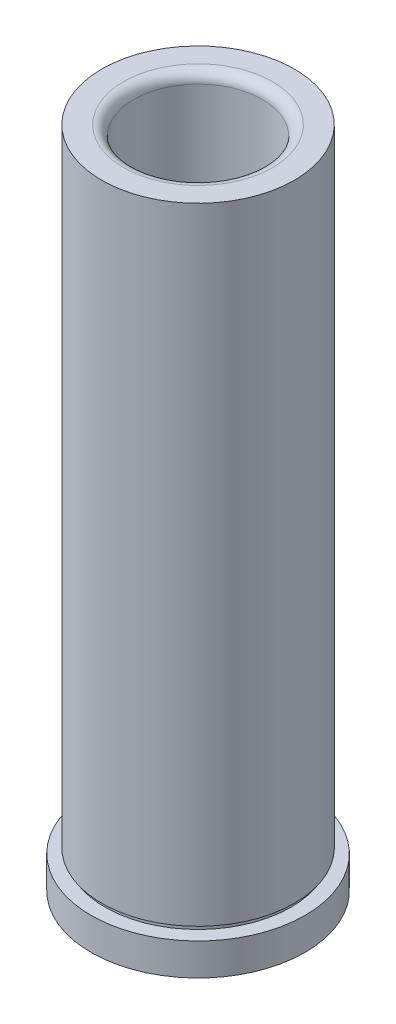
from build123d import *

# Parameters (mm, degrees)
FILLET1_R = 1.524


with BuildPart() as part:
    # Sketch1 → Revolve1 (revolve)
    with BuildSketch(Plane.XY, mode=Mode.PRIVATE) as revolve1_sk:
        with BuildLine():
            Line((-9.53135, 98.425), (-9.53135, 60.325))
            ThreePointArc((-9.53135, 60.325), (-10.429375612, 59.953025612), (-10.80135, 59.055))
            Line((-10.80135, 59.055), (-10.80135, 0.79375))
            Line((-10.80135, 0.79375), (-11.5951, 0))
            Line((-11.5951, 0), (-15.875, 0))
            Line((-15.875, 0), (-15.875, 4.7625))
            Line((-15.875, 4.7625), (-13.78585, 4.7625))
            Line((-13.78585, 4.7625), (-13.78585, 5.5245))
            Line((-13.78585, 5.5245), (-14.29385, 5.5245))
            Line((-14.29385, 5.5245), (-14.29385, 98.425))
            Line((-14.29385, 98.425), (-9.53135, 98.425))
        make_face()
    revolve(revolve1_sk.sketch.rotate(Axis((0, -1000, 0), (0, 1, 0)), 180), axis=Axis((0, -1000, 0), (0, 1, 0)))

    # Fillet1
    fillet1_edges = [part.edges().sort_by_distance(p)[0] for p in [
        (-9.53135, 98.425, 0),
    ]]
    fillet(fillet1_edges, radius=FILLET1_R)


solid = part.part
